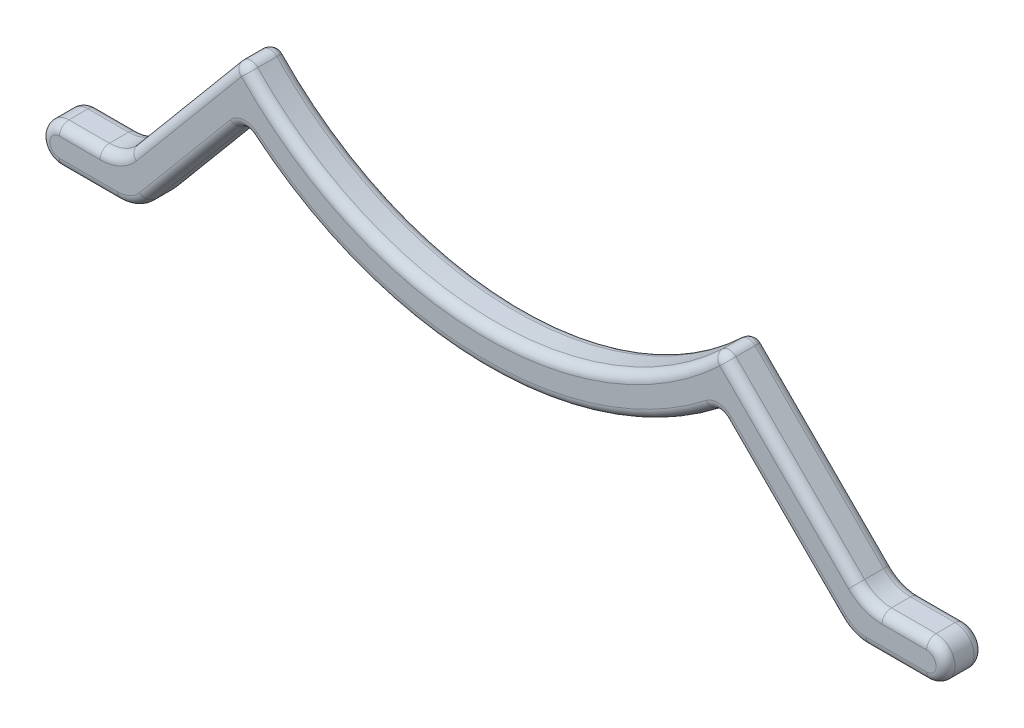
from build123d import *

# Parameters (mm, degrees)
BOSS_EXTRUDE1_DEPTH = 125
FILLET1_R           = 62.5


with BuildPart() as part:
    # Sketch1 → Boss-Extrude1 (new, symmetric)
    with BuildSketch(Plane.XY):
        with BuildLine():
            Line((-1658.330071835, -1508.958882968), (-2349.12200881, -2334.502491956))
            ThreePointArc((-2349.12200881, -2334.502491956), (-2435.04322426, -2400.572264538), (-2540.852671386, -2424.067604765))
            Line((-2540.852671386, -2424.067604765), (-2807.282538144, -2424.067604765))
            ThreePointArc((-2807.282538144, -2424.067604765), (-2932.282538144, -2549.067604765), (-2807.282538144, -2674.067604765))
            Line((-2807.282538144, -2674.067604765), (-2424.067604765, -2674.067604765))
            ThreePointArc((-2424.067604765, -2674.067604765), (-2318.258157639, -2650.572264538), (-2232.336942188, -2584.502491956))
            Line((-2232.336942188, -2584.502491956), (-1635.385117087, -1871.104234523))
            ThreePointArc((-1635.385117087, -1871.104234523), (-1593.098161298, -1848.96847094), (-1547.518549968, -1863.13454627))
            ThreePointArc((-1547.518549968, -1863.13454627), (-40.976322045, -2421.653348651), (1483.599230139, -1914.423496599))
            ThreePointArc((1483.599230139, -1914.423496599), (1525.822133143, -1901.44963852), (1566.077859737, -1919.63125033))
            Line((1566.077859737, -1919.63125033), (2321.8293944, -2675.382784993))
            ThreePointArc((2321.8293944, -2675.382784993), (2402.935231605, -2729.575972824), (2498.606089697, -2748.606089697))
            Line((2498.606089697, -2748.606089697), (2895.052699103, -2748.606089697))
            ThreePointArc((2895.052699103, -2748.606089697), (3020.052699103, -2623.606089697), (2895.052699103, -2498.606089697))
            Line((2895.052699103, -2498.606089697), (2602.15948029, -2498.606089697))
            ThreePointArc((2602.15948029, -2498.606089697), (2506.488622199, -2479.575972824), (2425.382784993, -2425.382784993))
            Line((2425.382784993, -2425.382784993), (1579.411915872, -1579.411915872))
            ThreePointArc((1579.411915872, -1579.411915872), (1536.091904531, -1561.112203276), (1492.276990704, -1578.193075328))
            ThreePointArc((1492.276990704, -1578.193075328), (-51.453260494, -2171.390467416), (-1565.353844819, -1505.739466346))
            ThreePointArc((-1565.353844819, -1505.739466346), (-1612.560249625, -1486.60503911), (-1658.330071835, -1508.958882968))
        make_face()
    extrude(amount=BOSS_EXTRUDE1_DEPTH, both=True)

    # Fillet1
    fillet1_edges = [part.edges().sort_by_distance(p)[0] for p in [
        (-2318.258157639, -2650.572264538, 125),
        (-1933.861029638, -2227.803363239, 125),
        (-2674.067604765, -2424.067604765, -125),
        (-2435.04322426, -2400.572264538, -125),
        (-2003.726040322, -1921.730687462, -125),
        (-1612.560249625, -1486.60503911, -125),
        (-1593.098161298, -1848.96847094, 125),
        (-51.453260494, -2171.390467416, -125),
        (1536.091904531, -1561.112203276, -125),
        (2002.397350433, -2002.397350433, -125),
        (2506.488622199, -2479.575972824, -125),
        (2748.606089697, -2498.606089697, -125),
        (3020.052699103, -2623.606089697, -125),
        (2696.8293944, -2748.606089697, -125),
        (2402.935231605, -2729.575972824, -125),
        (1943.953627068, -2297.507017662, -125),
        (1525.822133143, -1901.44963852, -125),
        (-40.976322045, -2421.653348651, 125),
        (-40.976322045, -2421.653348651, -125),
        (-1593.098161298, -1848.96847094, -125),
        (-1933.861029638, -2227.803363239, -125),
        (-2318.258157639, -2650.572264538, -125),
        (-2615.675071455, -2674.067604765, -125),
        (-2932.282538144, -2549.067604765, -125),
        (1525.822133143, -1901.44963852, 125),
        (1943.953627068, -2297.507017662, 125),
        (2402.935231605, -2729.575972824, 125),
        (2696.8293944, -2748.606089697, 125),
        (3020.052699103, -2623.606089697, 125),
        (2748.606089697, -2498.606089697, 125),
        (-2932.282538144, -2549.067604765, 125),
        (2506.488622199, -2479.575972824, 125),
        (2002.397350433, -2002.397350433, 125),
        (1536.091904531, -1561.112203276, 125),
        (-51.453260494, -2171.390467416, 125),
        (-1612.560249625, -1486.60503911, 125),
        (-2003.726040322, -1921.730687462, 125),
        (-2435.04322426, -2400.572264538, 125),
        (-2674.067604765, -2424.067604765, 125),
        (-2615.675071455, -2674.067604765, 125),
    ]]
    fillet(fillet1_edges, radius=FILLET1_R)


solid = part.part
